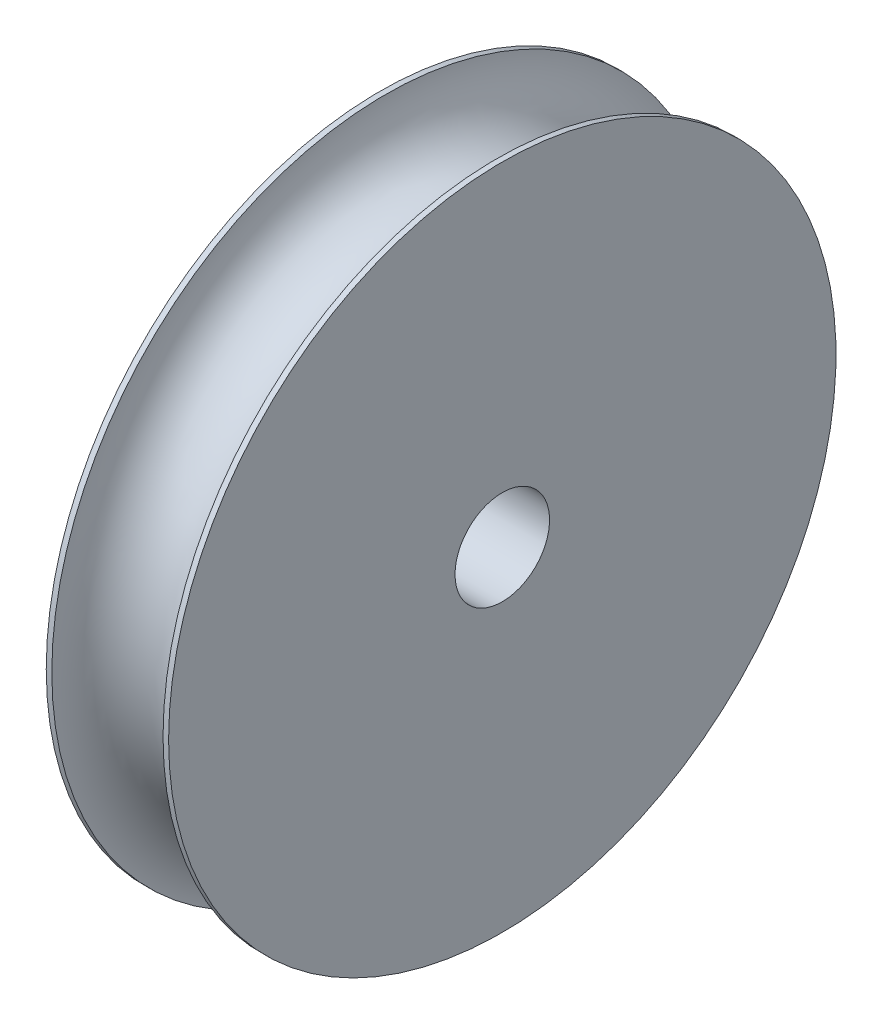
from build123d import *


with BuildPart() as part:
    # Esquisse1 → R_volution1 (revolve)
    with BuildSketch(Plane.XY, mode=Mode.PRIVATE) as r_volution1_sk:
        with BuildLine():
            Line((0, 17), (0, 120))
            Line((0, 120), (2, 120))
            ThreePointArc((2, 120), (22, 100), (42, 120))
            Line((42, 120), (44, 120))
            Line((44, 120), (44, 17))
            Line((44, 17), (0, 17))
        make_face()
    revolve(r_volution1_sk.sketch.rotate(Axis((0, 0, 0), (1, 0, 0)), 90), axis=Axis((0, 0, 0), (1, 0, 0)))


solid = part.part
